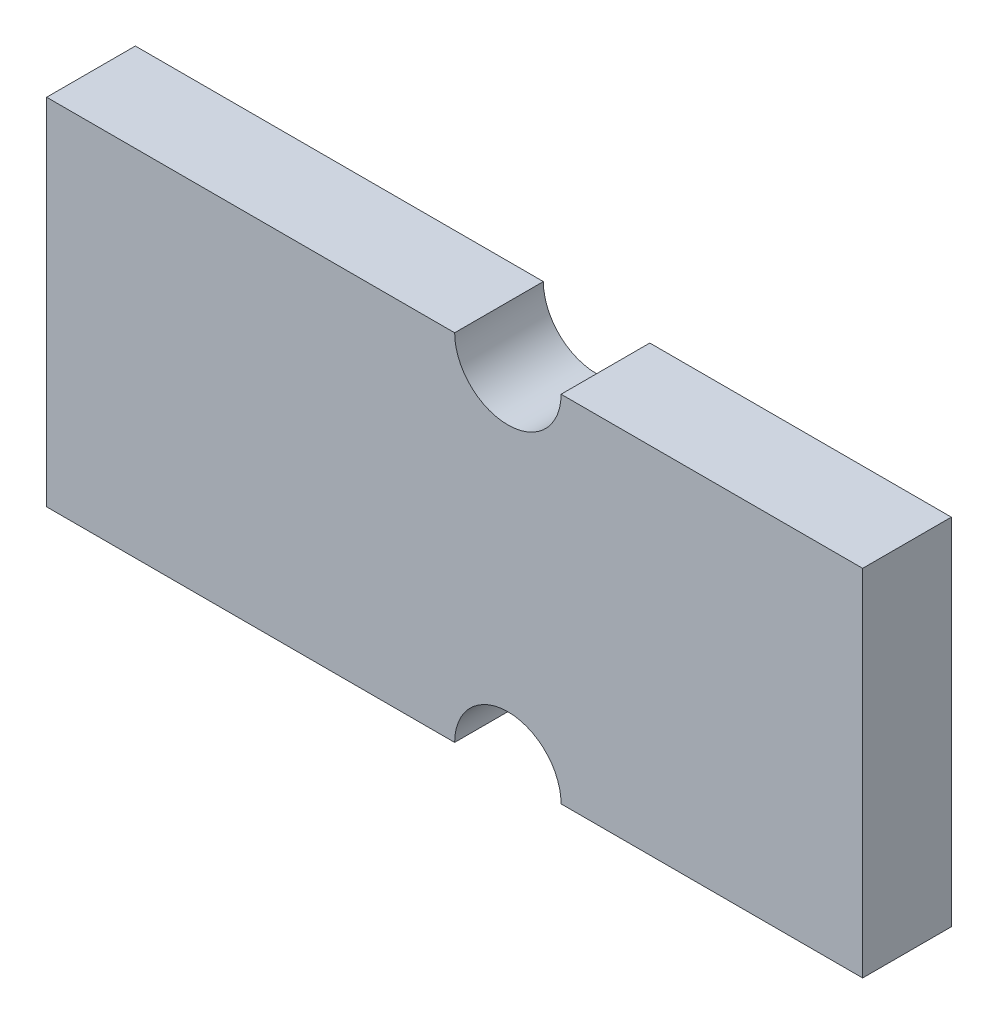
from build123d import *

# Parameters (mm, degrees)
BOSS_EXTRUDE1_DEPTH = 12.5


with BuildPart() as part:
    # Sketch1 → Boss-Extrude1 (new, symmetric)
    with BuildSketch(Plane.XY):
        with BuildLine():
            Line((115, 50), (30, 50))
            ThreePointArc((30, 50), (15, 35), (0, 50))
            Line((0, 50), (-115, 50))
            Line((-115, 50), (-115, -50))
            Line((-115, -50), (0, -50))
            ThreePointArc((0, -50), (15, -35), (30, -50))
            Line((30, -50), (115, -50))
            Line((115, -50), (115, 50))
        make_face()
    extrude(amount=BOSS_EXTRUDE1_DEPTH, both=True)


solid = part.part
